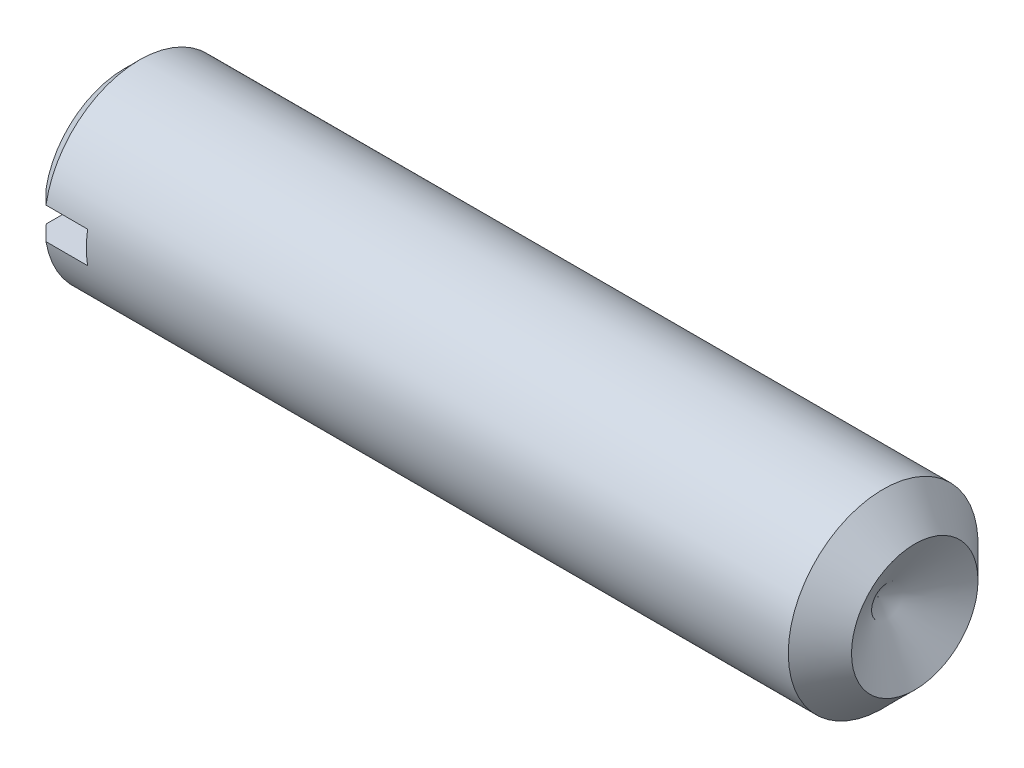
from build123d import *

# Parameters (mm, degrees)
SLOTSKE_W  = 12
SLOTSKE_H  = 2
SLOT_DEPTH = 3.6


with BuildPart() as part:
    # BodySke → BaseBody (revolve)
    with BuildSketch(Plane.XY, mode=Mode.PRIVATE) as basebody_sk:
        Polygon((0, 0), (0, 5.036), (0.964, 6), (48, 6), (50, 4), (47.690598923, 0), align=None)
    revolve(basebody_sk.sketch.rotate(Axis((0, 0, 0), (1, 0, 0)), 90), axis=Axis((0, 0, 0), (1, 0, 0)))

    # SlotSke → Slot (cut)
    with BuildSketch(Plane(origin=(0, 0, 0), x_dir=(0, 0, -1), z_dir=(1, 0, 0))):
        Rectangle(SLOTSKE_W, SLOTSKE_H)
    extrude(amount=SLOT_DEPTH, mode=Mode.SUBTRACT)


solid = part.part
